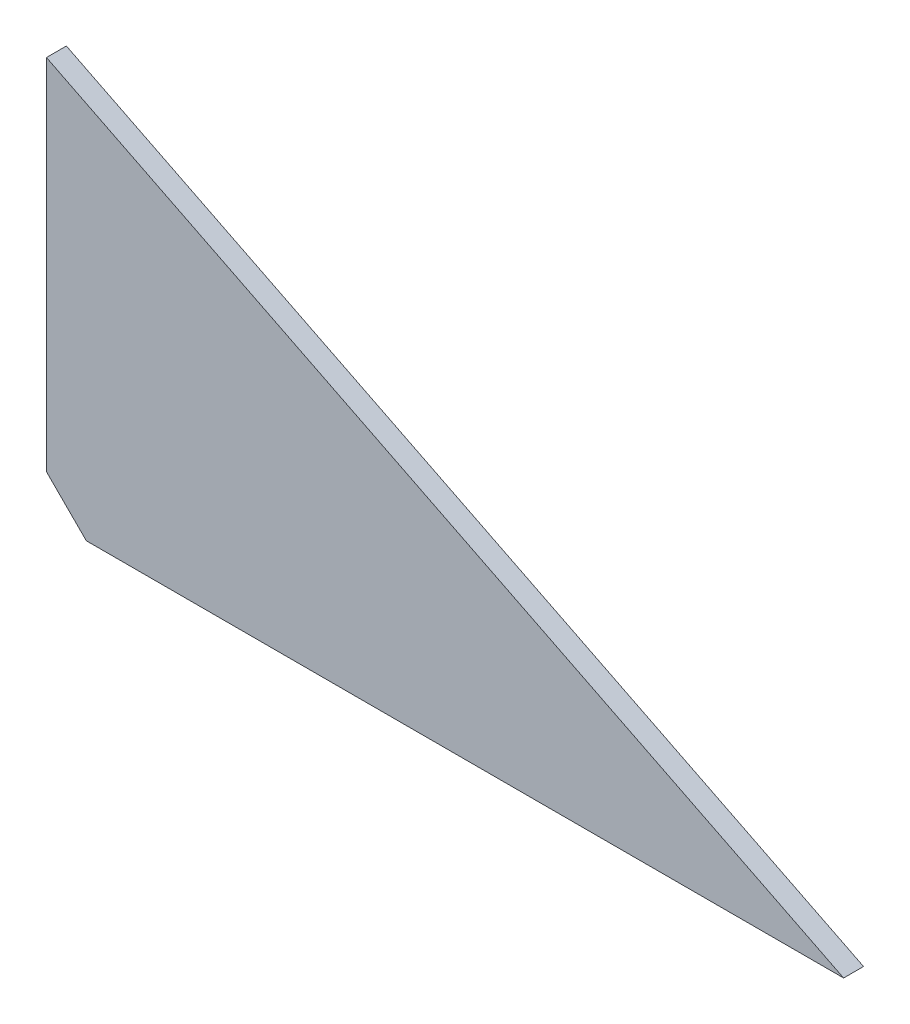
ISO-10303-21;
HEADER;
FILE_DESCRIPTION(('STEP AP214'),'2;1');
FILE_NAME('part.step','',(''),(''),'','','');
FILE_SCHEMA(('AUTOMOTIVE_DESIGN { 1 0 10303 214 1 1 1 1 }'));
ENDSEC;
DATA;
#1=APPLICATION_CONTEXT('core data for automotive mechanical design processes');
#2=APPLICATION_PROTOCOL_DEFINITION('international standard','automotive_design',2000,#1);
#3=PRODUCT_CONTEXT('',#1,'mechanical');
#4=PRODUCT('Part','Part','',(#3));
#5=PRODUCT_RELATED_PRODUCT_CATEGORY('part','',(#4));
#6=PRODUCT_DEFINITION_FORMATION('','',#4);
#7=PRODUCT_DEFINITION_CONTEXT('part definition',#1,'design');
#8=PRODUCT_DEFINITION('design','',#6,#7);
#9=PRODUCT_DEFINITION_SHAPE('','',#8);
#10=(LENGTH_UNIT() NAMED_UNIT(*) SI_UNIT(.MILLI.,.METRE.));
#11=(NAMED_UNIT(*) PLANE_ANGLE_UNIT() SI_UNIT($,.RADIAN.));
#12=(NAMED_UNIT(*) SI_UNIT($,.STERADIAN.) SOLID_ANGLE_UNIT());
#13=UNCERTAINTY_MEASURE_WITH_UNIT(LENGTH_MEASURE(1.E-05),#10,'distance_accuracy_value','');
#14=(GEOMETRIC_REPRESENTATION_CONTEXT(3) GLOBAL_UNCERTAINTY_ASSIGNED_CONTEXT((#13)) GLOBAL_UNIT_ASSIGNED_CONTEXT((#10,
#11,#12)) REPRESENTATION_CONTEXT('',''));
#15=CARTESIAN_POINT('',(0.,0.,0.));
#16=DIRECTION('',(0.,0.,1.));
#17=DIRECTION('',(1.,0.,0.));
#18=AXIS2_PLACEMENT_3D('',#15,#16,#17);
#19=CARTESIAN_POINT('',(0.,100.,2.5));
#20=DIRECTION('',(1.,0.,0.));
#21=DIRECTION('',(0.,1.,0.));
#22=AXIS2_PLACEMENT_3D('',#19,#20,#21);
#23=PLANE('',#22);
#24=DIRECTION('',(0.,-1.,0.));
#25=VECTOR('',#24,1.);
#26=CARTESIAN_POINT('',(0.,100.,-2.5));
#27=LINE('',#26,#25);
#28=CARTESIAN_POINT('',(0.,100.,-2.5));
#29=VERTEX_POINT('',#28);
#30=CARTESIAN_POINT('',(0.,10.,-2.5));
#31=VERTEX_POINT('',#30);
#32=EDGE_CURVE('E101',#29,#31,#27,.T.);
#33=ORIENTED_EDGE('',*,*,#32,.T.);
#34=DIRECTION('',(0.,0.,1.));
#35=VECTOR('',#34,1.);
#36=CARTESIAN_POINT('',(0.,10.,2.5));
#37=LINE('',#36,#35);
#38=CARTESIAN_POINT('',(0.,10.,2.5));
#39=VERTEX_POINT('',#38);
#40=EDGE_CURVE('E42',#31,#39,#37,.T.);
#41=ORIENTED_EDGE('',*,*,#40,.T.);
#42=DIRECTION('',(0.,-1.,0.));
#43=VECTOR('',#42,1.);
#44=CARTESIAN_POINT('',(0.,100.,2.5));
#45=LINE('',#44,#43);
#46=CARTESIAN_POINT('',(0.,100.,2.5));
#47=VERTEX_POINT('',#46);
#48=EDGE_CURVE('E84',#47,#39,#45,.T.);
#49=ORIENTED_EDGE('',*,*,#48,.F.);
#50=DIRECTION('',(0.,0.,-1.));
#51=VECTOR('',#50,1.);
#52=CARTESIAN_POINT('',(0.,100.,2.5));
#53=LINE('',#52,#51);
#54=EDGE_CURVE('E93',#47,#29,#53,.T.);
#55=ORIENTED_EDGE('',*,*,#54,.T.);
#56=EDGE_LOOP('',(#33,#41,#49,#55));
#57=FACE_BOUND('',#56,.T.);
#58=ADVANCED_FACE('F34',(#57),#23,.F.);
#59=CARTESIAN_POINT('',(0.,0.,2.5));
#60=DIRECTION('',(0.,1.,0.));
#61=DIRECTION('',(0.,0.,1.));
#62=AXIS2_PLACEMENT_3D('',#59,#60,#61);
#63=PLANE('',#62);
#64=DIRECTION('',(1.,0.,0.));
#65=VECTOR('',#64,1.);
#66=CARTESIAN_POINT('',(0.,0.,2.5));
#67=LINE('',#66,#65);
#68=CARTESIAN_POINT('',(9.99999999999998,0.,2.5));
#69=VERTEX_POINT('',#68);
#70=CARTESIAN_POINT('',(200.,0.,2.5));
#71=VERTEX_POINT('',#70);
#72=EDGE_CURVE('E74',#69,#71,#67,.T.);
#73=ORIENTED_EDGE('',*,*,#72,.F.);
#74=DIRECTION('',(0.,0.,-1.));
#75=VECTOR('',#74,1.);
#76=CARTESIAN_POINT('',(9.99999999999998,0.,2.5));
#77=LINE('',#76,#75);
#78=CARTESIAN_POINT('',(9.99999999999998,0.,-2.5));
#79=VERTEX_POINT('',#78);
#80=EDGE_CURVE('E92',#69,#79,#77,.T.);
#81=ORIENTED_EDGE('',*,*,#80,.T.);
#82=DIRECTION('',(1.,0.,0.));
#83=VECTOR('',#82,1.);
#84=CARTESIAN_POINT('',(0.,0.,-2.5));
#85=LINE('',#84,#83);
#86=CARTESIAN_POINT('',(200.,0.,-2.5));
#87=VERTEX_POINT('',#86);
#88=EDGE_CURVE('E89',#79,#87,#85,.T.);
#89=ORIENTED_EDGE('',*,*,#88,.T.);
#90=DIRECTION('',(0.,0.,-1.));
#91=VECTOR('',#90,1.);
#92=CARTESIAN_POINT('',(200.,0.,2.5));
#93=LINE('',#92,#91);
#94=EDGE_CURVE('E87',#71,#87,#93,.T.);
#95=ORIENTED_EDGE('',*,*,#94,.F.);
#96=EDGE_LOOP('',(#73,#81,#89,#95));
#97=FACE_BOUND('',#96,.T.);
#98=ADVANCED_FACE('F88',(#97),#63,.F.);
#99=CARTESIAN_POINT('',(0.,100.,2.5));
#100=DIRECTION('',(-0.447213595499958,-0.894427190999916,0.));
#101=DIRECTION('',(0.894427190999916,-0.447213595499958,0.));
#102=AXIS2_PLACEMENT_3D('',#99,#100,#101);
#103=PLANE('',#102);
#104=DIRECTION('',(-0.894427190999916,0.447213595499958,0.));
#105=VECTOR('',#104,1.);
#106=CARTESIAN_POINT('',(0.,100.,-2.5));
#107=LINE('',#106,#105);
#108=EDGE_CURVE('E104',#87,#29,#107,.T.);
#109=ORIENTED_EDGE('',*,*,#108,.T.);
#110=ORIENTED_EDGE('',*,*,#54,.F.);
#111=DIRECTION('',(-0.894427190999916,0.447213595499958,0.));
#112=VECTOR('',#111,1.);
#113=CARTESIAN_POINT('',(0.,100.,2.5));
#114=LINE('',#113,#112);
#115=EDGE_CURVE('E78',#71,#47,#114,.T.);
#116=ORIENTED_EDGE('',*,*,#115,.F.);
#117=ORIENTED_EDGE('',*,*,#94,.T.);
#118=EDGE_LOOP('',(#109,#110,#116,#117));
#119=FACE_BOUND('',#118,.T.);
#120=ADVANCED_FACE('F95',(#119),#103,.F.);
#121=CARTESIAN_POINT('',(0.,0.,2.5));
#122=DIRECTION('',(0.,0.,1.));
#123=DIRECTION('',(1.,0.,0.));
#124=AXIS2_PLACEMENT_3D('',#121,#122,#123);
#125=PLANE('',#124);
#126=ORIENTED_EDGE('',*,*,#48,.T.);
#127=DIRECTION('',(-0.707106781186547,0.707106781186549,0.));
#128=VECTOR('',#127,1.);
#129=CARTESIAN_POINT('',(5.,4.99999999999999,2.5));
#130=LINE('',#129,#128);
#131=EDGE_CURVE('E11',#39,#69,#130,.F.);
#132=ORIENTED_EDGE('',*,*,#131,.T.);
#133=ORIENTED_EDGE('',*,*,#72,.T.);
#134=ORIENTED_EDGE('',*,*,#115,.T.);
#135=EDGE_LOOP('',(#126,#132,#133,#134));
#136=FACE_BOUND('',#135,.T.);
#137=ADVANCED_FACE('F76',(#136),#125,.T.);
#138=CARTESIAN_POINT('',(0.,0.,-2.5));
#139=DIRECTION('',(0.,0.,1.));
#140=DIRECTION('',(1.,0.,0.));
#141=AXIS2_PLACEMENT_3D('',#138,#139,#140);
#142=PLANE('',#141);
#143=ORIENTED_EDGE('',*,*,#88,.F.);
#144=DIRECTION('',(0.707106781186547,-0.707106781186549,0.));
#145=VECTOR('',#144,1.);
#146=CARTESIAN_POINT('',(9.99999999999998,0.,-2.5));
#147=LINE('',#146,#145);
#148=EDGE_CURVE('E56',#79,#31,#147,.F.);
#149=ORIENTED_EDGE('',*,*,#148,.T.);
#150=ORIENTED_EDGE('',*,*,#32,.F.);
#151=ORIENTED_EDGE('',*,*,#108,.F.);
#152=EDGE_LOOP('',(#143,#149,#150,#151));
#153=FACE_BOUND('',#152,.T.);
#154=ADVANCED_FACE('F108',(#153),#142,.F.);
#155=CARTESIAN_POINT('',(9.99999999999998,0.,2.5));
#156=DIRECTION('',(0.707106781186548,0.707106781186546,0.));
#157=DIRECTION('',(0.,0.,-1.));
#158=AXIS2_PLACEMENT_3D('',#155,#156,#157);
#159=PLANE('',#158);
#160=ORIENTED_EDGE('',*,*,#131,.F.);
#161=ORIENTED_EDGE('',*,*,#40,.F.);
#162=ORIENTED_EDGE('',*,*,#148,.F.);
#163=ORIENTED_EDGE('',*,*,#80,.F.);
#164=EDGE_LOOP('',(#160,#161,#162,#163));
#165=FACE_BOUND('',#164,.T.);
#166=ADVANCED_FACE('F36',(#165),#159,.F.);
#167=CLOSED_SHELL('',(#58,#98,#120,#137,#154,#166));
#168=MANIFOLD_SOLID_BREP('B2',#167);
#169=ADVANCED_BREP_SHAPE_REPRESENTATION('',(#18,#168),#14);
#170=SHAPE_DEFINITION_REPRESENTATION(#9,#169);
ENDSEC;
END-ISO-10303-21;
